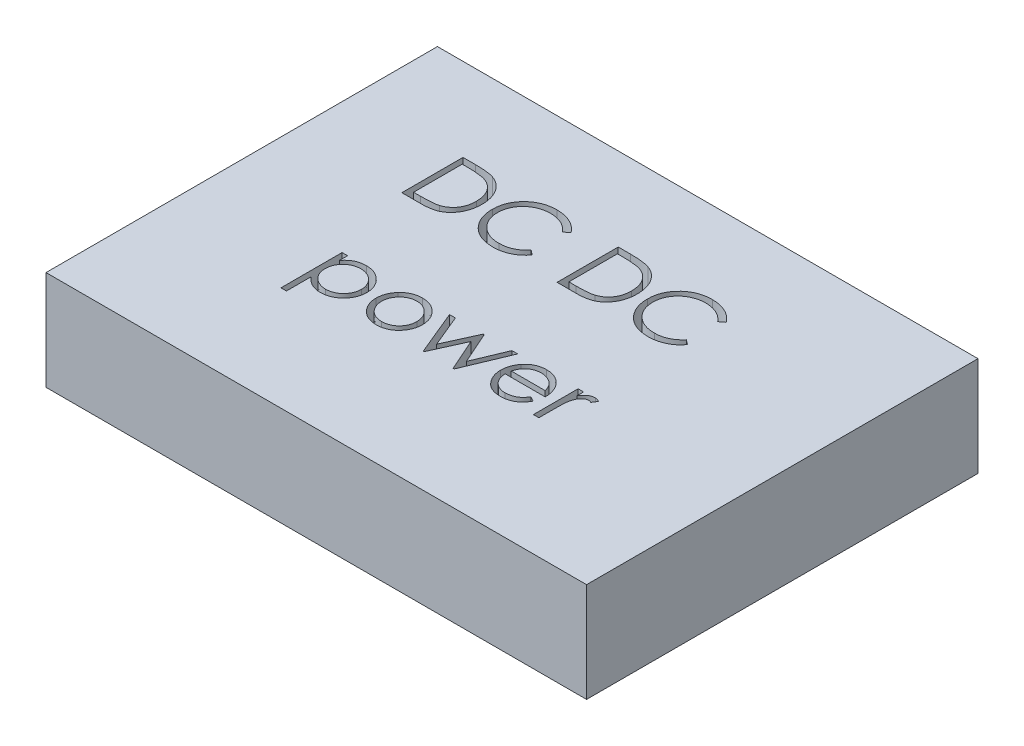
from build123d import *

# Parameters (mm, degrees)
SKETCH1_W           = 22.098
SKETCH1_H           = 16.002
BOSS_EXTRUDE1_DEPTH = 4.064
CUT_EXTRUDE1_DEPTH  = 1


with BuildPart() as part:
    # Sketch1 → Boss-Extrude1 (new body)
    with BuildSketch(Plane(origin=(0, 0, 0), x_dir=(1, 0, 0), z_dir=(0, 1, 0))):
        Rectangle(SKETCH1_W, SKETCH1_H)
    extrude(amount=BOSS_EXTRUDE1_DEPTH)

    # Sketch2 → Cut-Extrude1 (cut)
    # profile 1 of 9: a face of its own
    with BuildSketch(Plane(origin=(0, 4.064, 0), x_dir=(1, 0, 0), z_dir=(0, 1, 0))):
        with BuildLine():
            Line((-6.603142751, 2.100132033), (-6.603142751, 4.600132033))
            Line((-6.603142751, 4.600132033), (-6.098335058, 4.600132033))
            add(Edge.make_bspline(
                [(-6.098335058, 4.600132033), (-6.054428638, 4.599815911), (-5.969601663, 4.599205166), (-5.847021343, 4.595332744), (-5.73360437, 4.588482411), (-5.629723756, 4.578504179), (-5.535094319, 4.566252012), (-5.449981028, 4.55089458), (-5.373943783, 4.532760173), (-5.327179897, 4.517299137), (-5.305065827, 4.509987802)],
                knots=[0, 0, 0, 0, 1.314313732, 2.53924729, 3.670748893, 4.714932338, 5.66265055, 6.526160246, 7.303039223, 8, 8, 8, 8], degree=3))
            add(Edge.make_bspline(
                [(-5.305065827, 4.509987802), (-5.276141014, 4.498965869), (-5.218947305, 4.477171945), (-5.137513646, 4.436060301), (-5.060852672, 4.389479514), (-4.988553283, 4.337368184), (-4.922266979, 4.278250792), (-4.859404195, 4.214638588), (-4.802536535, 4.144218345), (-4.750459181, 4.068450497), (-4.703505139, 3.988227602), (-4.662691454, 3.903702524), (-4.628795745, 3.815304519), (-4.600657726, 3.723279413), (-4.578481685, 3.627424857), (-4.563351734, 3.527629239), (-4.553372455, 3.424286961), (-4.552369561, 3.354162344), (-4.551860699, 3.318581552)],
                knots=[0, 0, 0, 0, 0.984719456, 1.947108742, 2.898477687, 3.838006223, 4.779231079, 5.722358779, 6.681677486, 7.655904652, 8.64651281, 9.637519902, 10.640069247, 11.656948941, 12.698408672, 13.768548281, 14.867775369, 16, 16, 16, 16], degree=3))
            add(Edge.make_bspline(
                [(-4.551860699, 3.318581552), (-4.552309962, 3.287680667), (-4.55319528, 3.226787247), (-4.561144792, 3.13704375), (-4.572699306, 3.049962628), (-4.590588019, 2.965958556), (-4.6123041, 2.884295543), (-4.640135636, 2.80584394), (-4.672018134, 2.729884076), (-4.709196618, 2.657443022), (-4.750011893, 2.588812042), (-4.793813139, 2.524115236), (-4.840553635, 2.464275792), (-4.890679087, 2.409112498), (-4.943541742, 2.358708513), (-4.999487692, 2.312642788), (-5.0586613, 2.271816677), (-5.120797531, 2.234625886), (-5.187709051, 2.202182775), (-5.260663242, 2.174732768), (-5.339971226, 2.151985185), (-5.425438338, 2.133005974), (-5.517212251, 2.117950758), (-5.615382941, 2.107860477), (-5.719799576, 2.101036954), (-5.791499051, 2.10043953), (-5.828403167, 2.100132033)],
                knots=[0, 0, 0, 0, 1.105936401, 2.179363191, 3.223086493, 4.248585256, 5.251745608, 6.245858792, 7.225916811, 8.198733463, 9.158002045, 10.082870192, 10.993790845, 11.873723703, 12.748670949, 13.606408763, 14.465103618, 15.319838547, 16.196477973, 17.123216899, 18.106603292, 19.147568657, 20.255746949, 21.433717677, 22.679120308, 24, 24, 24, 24], degree=3))
            Line((-5.828403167, 2.100132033), (-6.603142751, 2.100132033))
        make_face()
        with BuildLine():
            Line((-6.378783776, 2.356542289), (-6.091824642, 2.356542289))
            add(Edge.make_bspline(
                [(-6.091824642, 2.356542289), (-6.050590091, 2.356719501), (-5.971280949, 2.357060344), (-5.857239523, 2.360051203), (-5.753039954, 2.364938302), (-5.658667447, 2.371777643), (-5.574175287, 2.380826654), (-5.499386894, 2.39091587), (-5.434547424, 2.403485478), (-5.395312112, 2.41487902), (-5.377181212, 2.420144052)],
                knots=[0, 0, 0, 0, 1.375205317, 2.645023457, 3.804390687, 4.853969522, 5.800190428, 6.637939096, 7.370582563, 8, 8, 8, 8], degree=3))
            add(Edge.make_bspline(
                [(-5.377181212, 2.420144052), (-5.354360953, 2.428180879), (-5.309265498, 2.444062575), (-5.244350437, 2.473032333), (-5.183809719, 2.507348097), (-5.126588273, 2.545492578), (-5.073497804, 2.588811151), (-5.02390915, 2.636361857), (-4.977922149, 2.688386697), (-4.936011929, 2.744821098), (-4.898505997, 2.805313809), (-4.866026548, 2.869270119), (-4.837561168, 2.935989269), (-4.815219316, 3.006495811), (-4.797708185, 3.080159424), (-4.785304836, 3.15698529), (-4.777580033, 3.236959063), (-4.776678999, 3.291353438), (-4.776219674, 3.319082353)],
                knots=[0, 0, 0, 0, 0.998632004, 1.973411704, 2.929992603, 3.868527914, 4.809262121, 5.754881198, 6.702106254, 7.672490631, 8.653608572, 9.636854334, 10.631411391, 11.644891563, 12.686317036, 13.754757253, 14.855430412, 16, 16, 16, 16], degree=3))
            add(Edge.make_bspline(
                [(-4.776219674, 3.319082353), (-4.776586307, 3.348320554), (-4.777306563, 3.405759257), (-4.786359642, 3.490038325), (-4.799589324, 3.571095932), (-4.818720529, 3.6489375), (-4.843099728, 3.723714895), (-4.873524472, 3.795014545), (-4.908286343, 3.863589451), (-4.949645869, 3.927856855), (-4.994942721, 3.988637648), (-5.045212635, 4.04431973), (-5.099656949, 4.095029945), (-5.157681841, 4.141558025), (-5.220922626, 4.182032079), (-5.287889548, 4.218236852), (-5.359565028, 4.248962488), (-5.409431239, 4.265304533), (-5.43477336, 4.273609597)],
                knots=[0, 0, 0, 0, 1.122418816, 2.205001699, 3.251619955, 4.274784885, 5.280384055, 6.268708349, 7.249350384, 8.229342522, 9.199999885, 10.157847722, 11.105861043, 12.055065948, 13.010012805, 13.98527497, 14.976112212, 16, 16, 16, 16], degree=3))
            add(Edge.make_bspline(
                [(-5.43477336, 4.273609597), (-5.455738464, 4.279407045), (-5.500316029, 4.291734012), (-5.573058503, 4.305180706), (-5.654926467, 4.317041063), (-5.746283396, 4.327082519), (-5.847025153, 4.334287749), (-5.957229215, 4.339695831), (-6.076943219, 4.343343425), (-6.159930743, 4.343592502), (-6.203002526, 4.343721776)],
                knots=[0, 0, 0, 0, 0.674548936, 1.434276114, 2.292660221, 3.240891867, 4.284742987, 5.42552168, 6.663806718, 8, 8, 8, 8], degree=3))
            Line((-6.203002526, 4.343721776), (-6.378783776, 4.343721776))
            Line((-6.378783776, 4.343721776), (-6.378783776, 2.356542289))
        make_face(mode=Mode.SUBTRACT)
    # profile 2 of 9: a face of its own
    with BuildSketch(Plane(origin=(0, 4.064, 0), x_dir=(1, 0, 0), z_dir=(0, 1, 0))):
        with BuildLine():
            Line((-1.731347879, 4.141398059), (-1.927661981, 3.991157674))
            add(Edge.make_bspline(
                [(-1.927661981, 3.991157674), (-1.941666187, 4.007847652), (-1.969485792, 4.041002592), (-2.014242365, 4.08755941), (-2.060886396, 4.131177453), (-2.109400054, 4.17206451), (-2.160656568, 4.208790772), (-2.213414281, 4.243270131), (-2.268555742, 4.274175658), (-2.344806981, 4.311649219), (-2.444555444, 4.350753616), (-2.570123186, 4.383541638), (-2.701202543, 4.404413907), (-2.790629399, 4.406674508), (-2.836115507, 4.407824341)],
                knots=[0, 0, 0, 0, 0.757959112, 1.505699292, 2.245454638, 2.979532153, 3.711538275, 4.438200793, 5.171680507, 5.909471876, 7.393775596, 8.890124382, 10.418191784, 12, 12, 12, 12], degree=3))
            add(Edge.make_bspline(
                [(-2.836115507, 4.407824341), (-2.861175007, 4.407535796), (-2.91106143, 4.406961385), (-2.985096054, 4.399383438), (-3.057748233, 4.388732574), (-3.128970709, 4.372928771), (-3.198672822, 4.352948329), (-3.267310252, 4.329073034), (-3.333889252, 4.299533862), (-3.399330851, 4.266885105), (-3.462030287, 4.230008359), (-3.521355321, 4.189784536), (-3.577089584, 4.146663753), (-3.629277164, 4.100484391), (-3.677971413, 4.051454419), (-3.722819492, 3.999051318), (-3.763666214, 3.943442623), (-3.801321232, 3.885361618), (-3.835044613, 3.824977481), (-3.863280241, 3.762066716), (-3.8882839, 3.697706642), (-3.908069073, 3.631170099), (-3.923729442, 3.562925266), (-3.934534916, 3.492788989), (-3.942026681, 3.420907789), (-3.942598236, 3.372186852), (-3.94288634, 3.347628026)],
                knots=[0, 0, 0, 0, 1.054917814, 2.100044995, 3.131103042, 4.146048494, 5.169673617, 6.183595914, 7.203665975, 8.234915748, 9.262203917, 10.264457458, 11.251630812, 12.227803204, 13.197192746, 14.159520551, 15.12972552, 16.100847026, 17.073214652, 18.039054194, 19.002613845, 19.979014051, 20.95965708, 21.949030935, 22.966165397, 24, 24, 24, 24], degree=3))
            add(Edge.make_bspline(
                [(-3.94288634, 3.347628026), (-3.941985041, 3.310677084), (-3.940215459, 3.238128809), (-3.924466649, 3.131864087), (-3.900534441, 3.030063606), (-3.864666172, 2.933363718), (-3.820438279, 2.840572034), (-3.764552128, 2.753258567), (-3.69982603, 2.670103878), (-3.625344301, 2.593073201), (-3.543625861, 2.522706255), (-3.455948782, 2.460741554), (-3.362531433, 2.409088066), (-3.264405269, 2.366105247), (-3.160815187, 2.333064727), (-3.051947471, 2.309804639), (-2.938038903, 2.294631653), (-2.860203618, 2.293179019), (-2.820590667, 2.292439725)],
                knots=[0, 0, 0, 0, 1.029171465, 2.020641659, 2.987623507, 3.938342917, 4.889210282, 5.84687017, 6.821220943, 7.821438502, 8.827599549, 9.822697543, 10.807740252, 11.797342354, 12.80366471, 13.83203677, 14.896651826, 16, 16, 16, 16], degree=3))
            add(Edge.make_bspline(
                [(-2.820590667, 2.292439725), (-2.776945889, 2.293645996), (-2.691042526, 2.296020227), (-2.565065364, 2.316133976), (-2.444468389, 2.348746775), (-2.329245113, 2.394388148), (-2.219720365, 2.453720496), (-2.115722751, 2.525647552), (-2.017164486, 2.610853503), (-1.957899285, 2.675912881), (-1.927661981, 2.709106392)],
                knots=[0, 0, 0, 0, 1.028121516, 2.023589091, 2.998037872, 3.967518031, 4.937445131, 5.927275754, 6.942489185, 8, 8, 8, 8], degree=3))
            Line((-1.927661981, 2.709106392), (-1.731347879, 2.560368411))
            add(Edge.make_bspline(
                [(-1.731347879, 2.560368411), (-1.747146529, 2.539983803), (-1.778668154, 2.499312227), (-1.829709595, 2.441975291), (-1.883479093, 2.388043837), (-1.940376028, 2.337952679), (-1.99974588, 2.290699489), (-2.062654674, 2.247626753), (-2.128275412, 2.208133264), (-2.196385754, 2.171971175), (-2.266913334, 2.139887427), (-2.339773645, 2.11242045), (-2.414652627, 2.088759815), (-2.491553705, 2.069294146), (-2.570636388, 2.054100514), (-2.651615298, 2.043943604), (-2.734665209, 2.036985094), (-2.790694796, 2.036350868), (-2.819088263, 2.036029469)],
                knots=[0, 0, 0, 0, 0.986787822, 1.968848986, 2.935600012, 3.899624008, 4.868462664, 5.837806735, 6.815139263, 7.798259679, 8.787526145, 9.778297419, 10.776456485, 11.791383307, 12.812564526, 13.85620153, 14.913611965, 16, 16, 16, 16], degree=3))
            add(Edge.make_bspline(
                [(-2.819088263, 2.036029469), (-2.845976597, 2.036216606), (-2.899144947, 2.036586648), (-2.977644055, 2.042581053), (-3.054065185, 2.050759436), (-3.128189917, 2.063073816), (-3.200422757, 2.077605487), (-3.270108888, 2.097084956), (-3.337934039, 2.11890579), (-3.403625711, 2.144552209), (-3.467239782, 2.173492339), (-3.528571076, 2.206200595), (-3.587591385, 2.242401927), (-3.644880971, 2.281298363), (-3.699593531, 2.324139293), (-3.752203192, 2.370329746), (-3.80300496, 2.41971404), (-3.83443545, 2.455324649), (-3.850238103, 2.473228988)],
                knots=[0, 0, 0, 0, 1.114604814, 2.203992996, 3.262667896, 4.300477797, 5.318619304, 6.316056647, 7.298880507, 8.271930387, 9.238335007, 10.195173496, 11.151986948, 12.108099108, 13.064862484, 14.031167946, 15.010108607, 16, 16, 16, 16], degree=3))
            add(Edge.make_bspline(
                [(-3.850238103, 2.473228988), (-3.875549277, 2.504329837), (-3.925866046, 2.566156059), (-3.990241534, 2.666360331), (-4.045346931, 2.77098048), (-4.08990116, 2.880566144), (-4.124731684, 2.99487142), (-4.148861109, 3.113953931), (-4.164540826, 3.237702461), (-4.16633389, 3.321871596), (-4.167245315, 3.36465527)],
                knots=[0, 0, 0, 0, 0.994628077, 1.977248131, 2.950237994, 3.925870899, 4.908910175, 5.911660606, 6.938484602, 8, 8, 8, 8], degree=3))
            add(Edge.make_bspline(
                [(-4.167245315, 3.36465527), (-4.166134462, 3.409623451), (-4.163948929, 3.49809554), (-4.145380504, 3.627934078), (-4.115509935, 3.752327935), (-4.073083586, 3.871044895), (-4.019294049, 3.984709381), (-3.952846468, 4.092453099), (-3.874512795, 4.194965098), (-3.78490739, 4.290689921), (-3.686645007, 4.37821803), (-3.581417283, 4.455222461), (-3.469430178, 4.519306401), (-3.351917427, 4.572875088), (-3.227999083, 4.614049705), (-3.097939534, 4.64287341), (-2.961983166, 4.660814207), (-2.86922429, 4.663082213), (-2.822093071, 4.664234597)],
                knots=[0, 0, 0, 0, 1.032925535, 2.032216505, 3.007276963, 3.968222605, 4.92396291, 5.891752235, 6.871517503, 7.883894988, 8.900124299, 9.891468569, 10.874487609, 11.85992873, 12.854644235, 13.869047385, 14.917252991, 16, 16, 16, 16], degree=3))
            add(Edge.make_bspline(
                [(-2.822093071, 4.664234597), (-2.793368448, 4.663890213), (-2.73651095, 4.663208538), (-2.652401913, 4.656561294), (-2.570514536, 4.645480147), (-2.490792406, 4.63039724), (-2.41284768, 4.611677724), (-2.33727608, 4.587291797), (-2.263634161, 4.55940856), (-2.192386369, 4.52729537), (-2.123874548, 4.491247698), (-2.058120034, 4.45166511), (-1.995645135, 4.408596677), (-1.936010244, 4.362408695), (-1.88021295, 4.312124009), (-1.826669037, 4.259125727), (-1.777196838, 4.201887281), (-1.746658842, 4.161598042), (-1.731347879, 4.141398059)],
                knots=[0, 0, 0, 0, 1.096760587, 2.17092713, 3.219439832, 4.250915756, 5.268269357, 6.278326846, 7.281116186, 8.274029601, 9.260640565, 10.235837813, 11.203064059, 12.156899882, 13.114053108, 14.069676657, 15.032185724, 16, 16, 16, 16], degree=3))
        make_face()
    # profile 3 of 9: a face of its own
    with BuildSketch(Plane(origin=(0, 4.064, 0), x_dir=(1, 0, 0), z_dir=(0, 1, 0))):
        with BuildLine():
            Line((-0.256988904, 2.100132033), (-0.256988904, 4.600132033))
            Line((-0.256988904, 4.600132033), (0.247818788, 4.600132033))
            add(Edge.make_bspline(
                [(0.247818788, 4.600132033), (0.291725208, 4.599815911), (0.376552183, 4.599205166), (0.499132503, 4.595332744), (0.612549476, 4.588482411), (0.71643009, 4.578504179), (0.811059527, 4.566252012), (0.896172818, 4.55089458), (0.972210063, 4.532760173), (1.018973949, 4.517299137), (1.041088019, 4.509987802)],
                knots=[0, 0, 0, 0, 1.314313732, 2.53924729, 3.670748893, 4.714932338, 5.66265055, 6.526160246, 7.303039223, 8, 8, 8, 8], degree=3))
            add(Edge.make_bspline(
                [(1.041088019, 4.509987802), (1.070012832, 4.498965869), (1.127206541, 4.477171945), (1.2086402, 4.436060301), (1.285301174, 4.389479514), (1.357600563, 4.337368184), (1.423886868, 4.278250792), (1.486749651, 4.214638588), (1.543617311, 4.144218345), (1.595694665, 4.068450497), (1.642648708, 3.988227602), (1.683462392, 3.903702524), (1.717358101, 3.815304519), (1.74549612, 3.723279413), (1.767672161, 3.627424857), (1.782802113, 3.527629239), (1.792781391, 3.424286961), (1.793784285, 3.354162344), (1.794293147, 3.318581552)],
                knots=[0, 0, 0, 0, 0.984719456, 1.947108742, 2.898477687, 3.838006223, 4.779231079, 5.722358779, 6.681677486, 7.655904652, 8.64651281, 9.637519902, 10.640069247, 11.656948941, 12.698408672, 13.768548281, 14.867775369, 16, 16, 16, 16], degree=3))
            add(Edge.make_bspline(
                [(1.794293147, 3.318581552), (1.793843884, 3.287680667), (1.792958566, 3.226787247), (1.785009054, 3.13704375), (1.77345454, 3.049962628), (1.755565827, 2.965958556), (1.733849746, 2.884295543), (1.70601821, 2.80584394), (1.674135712, 2.729884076), (1.636957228, 2.657443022), (1.596141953, 2.588812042), (1.552340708, 2.524115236), (1.505600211, 2.464275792), (1.455474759, 2.409112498), (1.402612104, 2.358708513), (1.346666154, 2.312642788), (1.287492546, 2.271816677), (1.225356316, 2.234625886), (1.158444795, 2.202182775), (1.085490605, 2.174732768), (1.00618262, 2.151985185), (0.920715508, 2.133005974), (0.828941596, 2.117950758), (0.730770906, 2.107860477), (0.62635427, 2.101036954), (0.554654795, 2.10043953), (0.517750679, 2.100132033)],
                knots=[0, 0, 0, 0, 1.105936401, 2.179363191, 3.223086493, 4.248585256, 5.251745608, 6.245858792, 7.225916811, 8.198733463, 9.158002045, 10.082870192, 10.993790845, 11.873723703, 12.748670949, 13.606408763, 14.465103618, 15.319838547, 16.196477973, 17.123216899, 18.106603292, 19.147568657, 20.255746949, 21.433717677, 22.679120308, 24, 24, 24, 24], degree=3))
            Line((0.517750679, 2.100132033), (-0.256988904, 2.100132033))
        make_face()
        with BuildLine():
            Line((-0.03262993, 2.356542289), (0.254329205, 2.356542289))
            add(Edge.make_bspline(
                [(0.254329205, 2.356542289), (0.295563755, 2.356719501), (0.374872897, 2.357060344), (0.488914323, 2.360051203), (0.593113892, 2.364938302), (0.687486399, 2.371777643), (0.771978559, 2.380826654), (0.846766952, 2.39091587), (0.911606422, 2.403485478), (0.950841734, 2.41487902), (0.968972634, 2.420144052)],
                knots=[0, 0, 0, 0, 1.375205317, 2.645023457, 3.804390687, 4.853969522, 5.800190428, 6.637939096, 7.370582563, 8, 8, 8, 8], degree=3))
            add(Edge.make_bspline(
                [(0.968972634, 2.420144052), (0.991792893, 2.428180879), (1.036888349, 2.444062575), (1.101803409, 2.473032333), (1.162344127, 2.507348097), (1.219565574, 2.545492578), (1.272656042, 2.588811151), (1.322244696, 2.636361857), (1.368231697, 2.688386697), (1.410141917, 2.744821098), (1.447647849, 2.805313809), (1.480127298, 2.869270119), (1.508592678, 2.935989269), (1.53093453, 3.006495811), (1.548445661, 3.080159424), (1.56084901, 3.15698529), (1.568573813, 3.236959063), (1.569474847, 3.291353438), (1.569934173, 3.319082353)],
                knots=[0, 0, 0, 0, 0.998632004, 1.973411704, 2.929992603, 3.868527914, 4.809262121, 5.754881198, 6.702106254, 7.672490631, 8.653608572, 9.636854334, 10.631411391, 11.644891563, 12.686317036, 13.754757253, 14.855430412, 16, 16, 16, 16], degree=3))
            add(Edge.make_bspline(
                [(1.569934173, 3.319082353), (1.569567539, 3.348320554), (1.568847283, 3.405759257), (1.559794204, 3.490038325), (1.546564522, 3.571095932), (1.527433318, 3.6489375), (1.503054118, 3.723714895), (1.472629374, 3.795014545), (1.437867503, 3.863589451), (1.396507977, 3.927856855), (1.351211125, 3.988637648), (1.300941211, 4.04431973), (1.246496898, 4.095029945), (1.188472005, 4.141558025), (1.12523122, 4.182032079), (1.058264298, 4.218236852), (0.986588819, 4.248962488), (0.936722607, 4.265304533), (0.911380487, 4.273609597)],
                knots=[0, 0, 0, 0, 1.122418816, 2.205001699, 3.251619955, 4.274784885, 5.280384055, 6.268708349, 7.249350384, 8.229342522, 9.199999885, 10.157847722, 11.105861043, 12.055065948, 13.010012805, 13.98527497, 14.976112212, 16, 16, 16, 16], degree=3))
            add(Edge.make_bspline(
                [(0.911380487, 4.273609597), (0.890415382, 4.279407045), (0.845837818, 4.291734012), (0.773095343, 4.305180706), (0.691227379, 4.317041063), (0.59987045, 4.327082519), (0.499128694, 4.334287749), (0.388924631, 4.339695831), (0.269210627, 4.343343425), (0.186223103, 4.343592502), (0.14315132, 4.343721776)],
                knots=[0, 0, 0, 0, 0.674548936, 1.434276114, 2.292660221, 3.240891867, 4.284742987, 5.42552168, 6.663806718, 8, 8, 8, 8], degree=3))
            Line((0.14315132, 4.343721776), (-0.03262993, 4.343721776))
            Line((-0.03262993, 4.343721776), (-0.03262993, 2.356542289))
        make_face(mode=Mode.SUBTRACT)
    # profile 4 of 9: a face of its own
    with BuildSketch(Plane(origin=(0, 4.064, 0), x_dir=(1, 0, 0), z_dir=(0, 1, 0))):
        with BuildLine():
            Line((4.614805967, 4.141398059), (4.418491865, 3.991157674))
            add(Edge.make_bspline(
                [(4.418491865, 3.991157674), (4.404487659, 4.007847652), (4.376668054, 4.041002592), (4.331911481, 4.08755941), (4.28526745, 4.131177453), (4.236753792, 4.17206451), (4.185497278, 4.208790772), (4.132739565, 4.243270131), (4.077598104, 4.274175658), (4.001346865, 4.311649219), (3.901598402, 4.350753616), (3.77603066, 4.383541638), (3.644951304, 4.404413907), (3.555524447, 4.406674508), (3.510038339, 4.407824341)],
                knots=[0, 0, 0, 0, 0.757959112, 1.505699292, 2.245454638, 2.979532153, 3.711538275, 4.438200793, 5.171680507, 5.909471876, 7.393775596, 8.890124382, 10.418191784, 12, 12, 12, 12], degree=3))
            add(Edge.make_bspline(
                [(3.510038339, 4.407824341), (3.48497884, 4.407535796), (3.435092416, 4.406961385), (3.361057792, 4.399383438), (3.288405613, 4.388732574), (3.217183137, 4.372928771), (3.147481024, 4.352948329), (3.078843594, 4.329073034), (3.012264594, 4.299533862), (2.946822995, 4.266885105), (2.884123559, 4.230008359), (2.824798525, 4.189784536), (2.769064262, 4.146663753), (2.716876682, 4.100484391), (2.668182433, 4.051454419), (2.623334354, 3.999051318), (2.582487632, 3.943442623), (2.544832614, 3.885361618), (2.511109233, 3.824977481), (2.482873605, 3.762066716), (2.457869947, 3.697706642), (2.438084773, 3.631170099), (2.422424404, 3.562925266), (2.41161893, 3.492788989), (2.404127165, 3.420907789), (2.40355561, 3.372186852), (2.403267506, 3.347628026)],
                knots=[0, 0, 0, 0, 1.054917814, 2.100044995, 3.131103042, 4.146048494, 5.169673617, 6.183595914, 7.203665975, 8.234915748, 9.262203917, 10.264457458, 11.251630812, 12.227803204, 13.197192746, 14.159520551, 15.12972552, 16.100847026, 17.073214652, 18.039054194, 19.002613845, 19.979014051, 20.95965708, 21.949030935, 22.966165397, 24, 24, 24, 24], degree=3))
            add(Edge.make_bspline(
                [(2.403267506, 3.347628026), (2.404168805, 3.310677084), (2.405938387, 3.238128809), (2.421687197, 3.131864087), (2.445619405, 3.030063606), (2.481487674, 2.933363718), (2.525715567, 2.840572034), (2.581601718, 2.753258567), (2.646327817, 2.670103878), (2.720809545, 2.593073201), (2.802527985, 2.522706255), (2.890205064, 2.460741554), (2.983622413, 2.409088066), (3.081748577, 2.366105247), (3.185338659, 2.333064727), (3.294206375, 2.309804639), (3.408114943, 2.294631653), (3.485950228, 2.293179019), (3.525563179, 2.292439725)],
                knots=[0, 0, 0, 0, 1.029171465, 2.020641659, 2.987623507, 3.938342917, 4.889210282, 5.84687017, 6.821220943, 7.821438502, 8.827599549, 9.822697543, 10.807740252, 11.797342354, 12.80366471, 13.83203677, 14.896651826, 16, 16, 16, 16], degree=3))
            add(Edge.make_bspline(
                [(3.525563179, 2.292439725), (3.569207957, 2.293645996), (3.65511132, 2.296020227), (3.781088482, 2.316133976), (3.901685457, 2.348746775), (4.016908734, 2.394388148), (4.126433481, 2.453720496), (4.230431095, 2.525647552), (4.32898936, 2.610853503), (4.388254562, 2.675912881), (4.418491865, 2.709106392)],
                knots=[0, 0, 0, 0, 1.028121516, 2.023589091, 2.998037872, 3.967518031, 4.937445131, 5.927275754, 6.942489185, 8, 8, 8, 8], degree=3))
            Line((4.418491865, 2.709106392), (4.614805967, 2.560368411))
            add(Edge.make_bspline(
                [(4.614805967, 2.560368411), (4.599007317, 2.539983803), (4.567485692, 2.499312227), (4.516444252, 2.441975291), (4.462674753, 2.388043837), (4.405777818, 2.337952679), (4.346407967, 2.290699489), (4.283499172, 2.247626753), (4.217878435, 2.208133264), (4.149768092, 2.171971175), (4.079240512, 2.139887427), (4.006380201, 2.11242045), (3.931501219, 2.088759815), (3.854600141, 2.069294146), (3.775517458, 2.054100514), (3.694538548, 2.043943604), (3.611488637, 2.036985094), (3.55545905, 2.036350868), (3.527065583, 2.036029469)],
                knots=[0, 0, 0, 0, 0.986787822, 1.968848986, 2.935600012, 3.899624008, 4.868462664, 5.837806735, 6.815139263, 7.798259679, 8.787526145, 9.778297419, 10.776456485, 11.791383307, 12.812564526, 13.85620153, 14.913611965, 16, 16, 16, 16], degree=3))
            add(Edge.make_bspline(
                [(3.527065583, 2.036029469), (3.500177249, 2.036216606), (3.447008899, 2.036586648), (3.368509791, 2.042581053), (3.292088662, 2.050759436), (3.217963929, 2.063073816), (3.14573109, 2.077605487), (3.076044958, 2.097084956), (3.008219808, 2.11890579), (2.942528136, 2.144552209), (2.878914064, 2.173492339), (2.81758277, 2.206200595), (2.758562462, 2.242401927), (2.701272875, 2.281298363), (2.646560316, 2.324139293), (2.593950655, 2.370329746), (2.543148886, 2.41971404), (2.511718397, 2.455324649), (2.495915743, 2.473228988)],
                knots=[0, 0, 0, 0, 1.114604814, 2.203992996, 3.262667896, 4.300477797, 5.318619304, 6.316056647, 7.298880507, 8.271930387, 9.238335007, 10.195173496, 11.151986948, 12.108099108, 13.064862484, 14.031167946, 15.010108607, 16, 16, 16, 16], degree=3))
            add(Edge.make_bspline(
                [(2.495915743, 2.473228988), (2.470604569, 2.504329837), (2.4202878, 2.566156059), (2.355912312, 2.666360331), (2.300806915, 2.77098048), (2.256252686, 2.880566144), (2.221422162, 2.99487142), (2.197292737, 3.113953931), (2.18161302, 3.237702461), (2.179819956, 3.321871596), (2.178908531, 3.36465527)],
                knots=[0, 0, 0, 0, 0.994628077, 1.977248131, 2.950237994, 3.925870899, 4.908910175, 5.911660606, 6.938484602, 8, 8, 8, 8], degree=3))
            add(Edge.make_bspline(
                [(2.178908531, 3.36465527), (2.180019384, 3.409623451), (2.182204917, 3.49809554), (2.200773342, 3.627934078), (2.230643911, 3.752327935), (2.27307026, 3.871044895), (2.326859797, 3.984709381), (2.393307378, 4.092453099), (2.471641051, 4.194965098), (2.561246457, 4.290689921), (2.659508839, 4.37821803), (2.764736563, 4.455222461), (2.876723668, 4.519306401), (2.994236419, 4.572875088), (3.118154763, 4.614049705), (3.248214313, 4.64287341), (3.38417068, 4.660814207), (3.476929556, 4.663082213), (3.524060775, 4.664234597)],
                knots=[0, 0, 0, 0, 1.032925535, 2.032216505, 3.007276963, 3.968222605, 4.92396291, 5.891752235, 6.871517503, 7.883894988, 8.900124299, 9.891468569, 10.874487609, 11.85992873, 12.854644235, 13.869047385, 14.917252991, 16, 16, 16, 16], degree=3))
            add(Edge.make_bspline(
                [(3.524060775, 4.664234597), (3.552785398, 4.663890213), (3.609642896, 4.663208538), (3.693751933, 4.656561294), (3.77563931, 4.645480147), (3.85536144, 4.63039724), (3.933306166, 4.611677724), (4.008877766, 4.587291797), (4.082519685, 4.55940856), (4.153767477, 4.52729537), (4.222279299, 4.491247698), (4.288033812, 4.45166511), (4.350508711, 4.408596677), (4.410143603, 4.362408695), (4.465940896, 4.312124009), (4.519484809, 4.259125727), (4.568957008, 4.201887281), (4.599495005, 4.161598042), (4.614805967, 4.141398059)],
                knots=[0, 0, 0, 0, 1.096760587, 2.17092713, 3.219439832, 4.250915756, 5.268269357, 6.278326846, 7.281116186, 8.274029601, 9.260640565, 10.235837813, 11.203064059, 12.156899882, 13.114053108, 14.069676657, 15.032185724, 16, 16, 16, 16], degree=3))
        make_face()
    # profile 5 of 9: a face of its own
    with BuildSketch(Plane(origin=(0, 4.064, 0), x_dir=(1, 0, 0), z_dir=(0, 1, 0))):
        with BuildLine():
            Line((-5.705706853, -1.239611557), (-5.481347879, -1.239611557))
            Line((-5.481347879, -1.239611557), (-5.481347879, -1.577652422))
            add(Edge.make_bspline(
                [(-5.481347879, -1.577652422), (-5.457521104, -1.546982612), (-5.411218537, -1.487381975), (-5.331415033, -1.410246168), (-5.247181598, -1.34519238), (-5.156350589, -1.294204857), (-5.060333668, -1.25576142), (-4.95952487, -1.227347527), (-4.853068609, -1.210603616), (-4.780285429, -1.208588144), (-4.743166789, -1.207560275)],
                knots=[0, 0, 0, 0, 1.0828784, 2.104357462, 3.088488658, 4.04616522, 5.001424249, 5.969181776, 6.964304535, 8, 8, 8, 8], degree=3))
            add(Edge.make_bspline(
                [(-4.743166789, -1.207560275), (-4.710744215, -1.20849826), (-4.646659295, -1.210352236), (-4.552328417, -1.222904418), (-4.461488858, -1.244417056), (-4.374654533, -1.275417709), (-4.290895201, -1.313743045), (-4.211450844, -1.362112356), (-4.135084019, -1.418116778), (-4.063715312, -1.482568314), (-3.997771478, -1.55230279), (-3.940738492, -1.627318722), (-3.891544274, -1.705149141), (-3.851779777, -1.787000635), (-3.820630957, -1.872228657), (-3.798477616, -1.961177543), (-3.785293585, -2.0535175), (-3.783524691, -2.116305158), (-3.78262993, -2.148065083)],
                knots=[0, 0, 0, 0, 1.041296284, 2.058176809, 3.050446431, 4.034000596, 5.01514041, 6.003636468, 7.015969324, 8.052561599, 9.08815499, 10.094063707, 11.074456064, 12.040834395, 13.011057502, 13.983766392, 14.980127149, 16, 16, 16, 16], degree=3))
            add(Edge.make_bspline(
                [(-3.78262993, -2.148065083), (-3.783505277, -2.180495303), (-3.785231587, -2.244452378), (-3.798620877, -2.338371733), (-3.820018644, -2.428719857), (-3.850774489, -2.515346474), (-3.89051841, -2.598191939), (-3.93887881, -2.677196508), (-3.995940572, -2.752334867), (-4.061155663, -2.822586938), (-4.131907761, -2.887300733), (-4.207534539, -2.943899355), (-4.286862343, -2.991428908), (-4.369485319, -3.031131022), (-4.456110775, -3.061054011), (-4.546334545, -3.082638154), (-4.640107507, -3.095948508), (-4.703894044, -3.097700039), (-4.736155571, -3.098585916)],
                knots=[0, 0, 0, 0, 1.038740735, 2.04854663, 3.033179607, 4.009277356, 4.987731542, 5.972001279, 6.972200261, 8.005528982, 9.039189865, 10.040446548, 11.026516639, 11.997840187, 12.972163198, 13.956796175, 14.96660207, 16, 16, 16, 16], degree=3))
            add(Edge.make_bspline(
                [(-4.736155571, -3.098585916), (-4.77246098, -3.097661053), (-4.844174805, -3.095834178), (-4.949030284, -3.077320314), (-5.049942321, -3.049651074), (-5.14579291, -3.009151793), (-5.237341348, -2.95754071), (-5.324069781, -2.894604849), (-5.40643889, -2.820475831), (-5.456016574, -2.76423882), (-5.481347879, -2.735504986)],
                knots=[0, 0, 0, 0, 1.014726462, 2.004382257, 2.969841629, 3.936926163, 4.907207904, 5.903978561, 6.929055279, 8, 8, 8, 8], degree=3))
            Line((-5.481347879, -2.735504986), (-5.481347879, -3.739611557))
            Line((-5.481347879, -3.739611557), (-5.705706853, -3.739611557))
            Line((-5.705706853, -3.739611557), (-5.705706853, -1.239611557))
        make_face()
        with BuildLine():
            add(Edge.make_bspline(
                [(-4.745169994, -1.431919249), (-4.770583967, -1.432376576), (-4.82061753, -1.433276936), (-4.893954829, -1.443972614), (-4.964594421, -1.459499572), (-5.031824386, -1.483008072), (-5.096289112, -1.511864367), (-5.157492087, -1.547922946), (-5.215390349, -1.590531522), (-5.269838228, -1.638873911), (-5.319026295, -1.692141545), (-5.362571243, -1.74898998), (-5.39914789, -1.809347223), (-5.429506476, -1.872651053), (-5.452608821, -1.939397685), (-5.469005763, -2.00920698), (-5.479313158, -2.082155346), (-5.480662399, -2.131838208), (-5.481347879, -2.157079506)],
                knots=[0, 0, 0, 0, 1.05670511, 2.080379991, 3.077984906, 4.06214886, 5.038337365, 6.01289324, 7.01187578, 8.025460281, 9.038092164, 10.024533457, 11.000252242, 11.969694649, 12.940728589, 13.933144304, 14.949937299, 16, 16, 16, 16], degree=3))
            add(Edge.make_bspline(
                [(-5.481347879, -2.157079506), (-5.480211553, -2.190213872), (-5.477985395, -2.255126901), (-5.459887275, -2.349972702), (-5.430433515, -2.439723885), (-5.38862729, -2.523624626), (-5.335807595, -2.600755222), (-5.272166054, -2.669819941), (-5.198278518, -2.730384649), (-5.115373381, -2.78139983), (-5.02650043, -2.822819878), (-4.933796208, -2.852472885), (-4.838535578, -2.870738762), (-4.774129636, -2.873057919), (-4.741664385, -2.874226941)],
                knots=[0, 0, 0, 0, 1.03728447, 2.032128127, 3.01272805, 3.987917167, 4.958271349, 5.931593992, 6.91984656, 7.941419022, 8.973179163, 9.983609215, 10.983593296, 12, 12, 12, 12], degree=3))
            add(Edge.make_bspline(
                [(-4.741664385, -2.874226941), (-4.709853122, -2.873115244), (-4.646713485, -2.870908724), (-4.553743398, -2.851810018), (-4.463392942, -2.822635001), (-4.377549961, -2.78009246), (-4.296961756, -2.727956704), (-4.224189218, -2.665413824), (-4.160612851, -2.592921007), (-4.106424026, -2.512200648), (-4.062758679, -2.425646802), (-4.029951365, -2.336088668), (-4.01101667, -2.243841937), (-4.008333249, -2.181700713), (-4.006988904, -2.150569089)],
                knots=[0, 0, 0, 0, 1.00104056, 1.986885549, 2.97790532, 3.984399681, 4.995088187, 5.994304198, 6.996462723, 8.023150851, 9.048424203, 10.043036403, 11.019596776, 12, 12, 12, 12], degree=3))
            add(Edge.make_bspline(
                [(-4.006988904, -2.150569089), (-4.008028, -2.119244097), (-4.010098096, -2.056838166), (-4.030488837, -1.964864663), (-4.061131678, -1.87494468), (-4.105816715, -1.789572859), (-4.158817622, -1.709019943), (-4.22292262, -1.637910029), (-4.294791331, -1.575645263), (-4.375283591, -1.524205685), (-4.46166961, -1.483287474), (-4.552608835, -1.453370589), (-4.64763998, -1.43538934), (-4.712374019, -1.433086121), (-4.745169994, -1.431919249)],
                knots=[0, 0, 0, 0, 0.983928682, 1.960191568, 2.949917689, 3.96440592, 4.982380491, 5.975291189, 6.965713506, 7.964880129, 8.970154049, 9.96478489, 10.968906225, 12, 12, 12, 12], degree=3))
        make_face(mode=Mode.SUBTRACT)
    # profile 6 of 9: a face of its own
    with BuildSketch(Plane(origin=(0, 4.064, 0), x_dir=(1, 0, 0), z_dir=(0, 1, 0))):
        with BuildLine():
            add(Edge.make_bspline(
                [(-2.451500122, -1.207560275), (-2.417220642, -1.208290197), (-2.350006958, -1.209721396), (-2.251572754, -1.2250178), (-2.157611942, -1.248408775), (-2.067764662, -1.280745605), (-1.983181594, -1.324089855), (-1.902630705, -1.375810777), (-1.826332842, -1.437084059), (-1.780602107, -1.484482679), (-1.757389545, -1.508541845)],
                knots=[0, 0, 0, 0, 1.054011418, 2.066658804, 3.057071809, 4.030435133, 4.997543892, 5.974964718, 6.972108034, 8, 8, 8, 8], degree=3))
            add(Edge.make_bspline(
                [(-1.757389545, -1.508541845), (-1.737402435, -1.531551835), (-1.697815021, -1.577126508), (-1.647053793, -1.651023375), (-1.603324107, -1.727552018), (-1.568279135, -1.80772868), (-1.540646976, -1.890853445), (-1.521028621, -1.977212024), (-1.509359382, -2.066613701), (-1.507785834, -2.127330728), (-1.506988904, -2.158081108)],
                knots=[0, 0, 0, 0, 1.025258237, 2.030674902, 3.01204498, 3.988269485, 4.97094183, 5.956517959, 6.965070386, 8, 8, 8, 8], degree=3))
            add(Edge.make_bspline(
                [(-1.506988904, -2.158081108), (-1.50768986, -2.189009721), (-1.50907498, -2.250126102), (-1.522177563, -2.340139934), (-1.54255691, -2.427421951), (-1.571722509, -2.511606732), (-1.609121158, -2.592951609), (-1.654757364, -2.671101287), (-1.708951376, -2.746209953), (-1.770382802, -2.817639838), (-1.838276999, -2.883472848), (-1.911931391, -2.940850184), (-1.989898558, -2.990008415), (-2.073215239, -3.029605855), (-2.161120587, -3.06082707), (-2.253804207, -3.082755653), (-2.351122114, -3.096013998), (-2.417570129, -3.097716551), (-2.451500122, -3.098585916)],
                knots=[0, 0, 0, 0, 0.998656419, 1.973391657, 2.932242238, 3.890759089, 4.846373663, 5.82037756, 6.809684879, 7.83454468, 8.860553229, 9.859544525, 10.845671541, 11.83227036, 12.833544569, 13.85385346, 14.904124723, 16, 16, 16, 16], degree=3))
            add(Edge.make_bspline(
                [(-2.451500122, -3.098585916), (-2.485596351, -3.097713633), (-2.552375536, -3.096005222), (-2.650036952, -3.082807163), (-2.74288668, -3.060837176), (-2.830907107, -3.029503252), (-2.914581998, -2.99000715), (-2.993000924, -2.9409988), (-3.06671515, -2.883455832), (-3.13462371, -2.817644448), (-3.196051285, -2.746208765), (-3.250246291, -2.671101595), (-3.295882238, -2.592951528), (-3.333280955, -2.511606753), (-3.362446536, -2.427421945), (-3.382825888, -2.340139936), (-3.39592847, -2.250126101), (-3.39731359, -2.189009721), (-3.398014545, -2.158081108)],
                knots=[0, 0, 0, 0, 1.099876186, 2.154163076, 3.173186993, 4.173200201, 5.163417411, 6.152872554, 7.150605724, 8.17532212, 9.198891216, 10.186952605, 11.159729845, 12.11414092, 13.071450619, 14.029093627, 15.002601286, 16, 16, 16, 16], degree=3))
            add(Edge.make_bspline(
                [(-3.398014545, -2.158081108), (-3.397212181, -2.127497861), (-3.395623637, -2.066948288), (-3.383966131, -1.977714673), (-3.364424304, -1.891502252), (-3.336759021, -1.808698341), (-3.301391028, -1.72887303), (-3.258275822, -1.652155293), (-3.206996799, -1.578592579), (-3.167566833, -1.533076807), (-3.147613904, -1.510044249)],
                knots=[0, 0, 0, 0, 1.031353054, 2.041901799, 3.029428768, 4.008703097, 4.981709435, 5.96992636, 6.972712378, 8, 8, 8, 8], degree=3))
            add(Edge.make_bspline(
                [(-3.147613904, -1.510044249), (-3.124436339, -1.485776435), (-3.07885358, -1.43804951), (-3.002175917, -1.37695485), (-2.921823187, -1.324157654), (-2.836305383, -1.281674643), (-2.746531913, -1.248218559), (-2.652089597, -1.224957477), (-2.553321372, -1.209776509), (-2.485778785, -1.208306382), (-2.451500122, -1.207560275)],
                knots=[0, 0, 0, 0, 1.027980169, 2.021703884, 2.998553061, 3.971491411, 4.943284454, 5.930300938, 6.949603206, 8, 8, 8, 8], degree=3))
        make_face()
        with BuildLine():
            add(Edge.make_bspline(
                [(-2.452501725, -1.431919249), (-2.476742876, -1.432608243), (-2.524599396, -1.433968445), (-2.595041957, -1.444314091), (-2.662856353, -1.460705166), (-2.728171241, -1.483993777), (-2.790766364, -1.514064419), (-2.850701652, -1.550998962), (-2.908153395, -1.594308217), (-2.961997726, -1.643924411), (-3.011413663, -1.698123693), (-3.054612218, -1.755872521), (-3.091344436, -1.816234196), (-3.12194455, -1.87927149), (-3.144735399, -1.945623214), (-3.161287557, -2.014537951), (-3.171623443, -2.086156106), (-3.172970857, -2.134842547), (-3.173655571, -2.159583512)],
                knots=[0, 0, 0, 0, 1.021534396, 2.016698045, 2.994645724, 3.958388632, 4.93408049, 5.916473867, 6.921342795, 7.962252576, 8.998418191, 10.008913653, 10.997312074, 11.973003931, 12.956656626, 13.948281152, 14.957379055, 16, 16, 16, 16], degree=3))
            add(Edge.make_bspline(
                [(-3.173655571, -2.159583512), (-3.17250784, -2.191549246), (-3.170229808, -2.25499525), (-3.151704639, -2.348431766), (-3.120714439, -2.438133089), (-3.078866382, -2.523573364), (-3.026433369, -2.602624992), (-2.964656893, -2.673104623), (-2.894199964, -2.733951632), (-2.815902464, -2.78443795), (-2.731363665, -2.824552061), (-2.641894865, -2.852979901), (-2.548580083, -2.871459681), (-2.484808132, -2.873296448), (-2.452501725, -2.874226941)],
                knots=[0, 0, 0, 0, 1.016792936, 2.018143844, 3.017858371, 4.030088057, 5.03801393, 6.028138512, 7.003788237, 7.991172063, 8.984598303, 9.972568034, 10.972917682, 12, 12, 12, 12], degree=3))
            add(Edge.make_bspline(
                [(-2.452501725, -2.874226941), (-2.420197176, -2.873291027), (-2.356428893, -2.871443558), (-2.263243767, -2.853072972), (-2.174019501, -2.8244275), (-2.08956851, -2.784483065), (-2.01130665, -2.733759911), (-1.940342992, -2.673448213), (-1.879093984, -2.60243832), (-1.826712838, -2.523468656), (-1.78417945, -2.438265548), (-1.753334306, -2.34841521), (-1.734764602, -2.254999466), (-1.732492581, -2.191550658), (-1.731347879, -2.159583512)],
                knots=[0, 0, 0, 0, 1.02726834, 2.027799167, 3.010890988, 4.004497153, 4.992059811, 5.971914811, 6.958719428, 7.966827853, 8.981595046, 9.981490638, 10.983022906, 12, 12, 12, 12], degree=3))
            add(Edge.make_bspline(
                [(-1.731347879, -2.159583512), (-1.732032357, -2.134842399), (-1.733379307, -2.086155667), (-1.743718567, -2.014539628), (-1.760258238, -1.945617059), (-1.783095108, -1.8792942), (-1.81356226, -1.816070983), (-1.851002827, -1.756049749), (-1.894024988, -1.697923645), (-1.944037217, -1.644099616), (-1.997825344, -1.594288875), (-2.055300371, -1.550982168), (-2.115146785, -1.514226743), (-2.177560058, -1.483736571), (-2.242883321, -1.460917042), (-2.310602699, -1.444219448), (-2.380744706, -1.434012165), (-2.428429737, -1.43262135), (-2.452501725, -1.431919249)],
                knots=[0, 0, 0, 0, 1.042956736, 2.052379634, 3.044323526, 4.02829302, 5.004299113, 5.996692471, 7.007513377, 8.048758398, 9.090003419, 10.095195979, 11.07790575, 12.047570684, 13.018257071, 13.989683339, 14.985167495, 16, 16, 16, 16], degree=3))
        make_face(mode=Mode.SUBTRACT)
    # profile 7 of 9: a face of its own
    with BuildSketch(Plane(origin=(0, 4.064, 0), x_dir=(1, 0, 0), z_dir=(0, 1, 0))):
        Polygon((-1.314681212, -1.239611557), (-1.073795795, -1.239611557), (-0.529424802, -2.553714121), (0.067029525, -1.239611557), (0.105090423, -1.239611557), (0.688523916, -2.553714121), (1.237902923, -1.239611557), (1.473780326, -1.239611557), (0.710058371, -3.066534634), (0.663483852, -3.066534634), (0.079549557, -1.75243207), (-0.516403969, -3.066534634), (-0.557970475, -3.066534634), align=None)
    # profile 8 of 9: a face of its own
    with BuildSketch(Plane(origin=(0, 4.064, 0), x_dir=(1, 0, 0), z_dir=(0, 1, 0))):
        with BuildLine():
            Line((3.261640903, -2.489611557), (3.460959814, -2.594279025))
            add(Edge.make_bspline(
                [(3.460959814, -2.594279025), (3.445076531, -2.622452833), (3.414173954, -2.677267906), (3.361030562, -2.752576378), (3.305321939, -2.820324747), (3.244533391, -2.878703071), (3.18048362, -2.929596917), (3.112817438, -2.974123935), (3.041182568, -3.012065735), (2.965575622, -3.044031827), (2.885361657, -3.068610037), (2.800346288, -3.085970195), (2.710366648, -3.096701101), (2.648690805, -3.09794763), (2.617109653, -3.098585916)],
                knots=[0, 0, 0, 0, 1.120438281, 2.179929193, 3.190490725, 4.156257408, 5.095198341, 6.022838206, 6.959905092, 7.901321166, 8.864066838, 9.862729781, 10.905609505, 12, 12, 12, 12], degree=3))
            add(Edge.make_bspline(
                [(2.617109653, -3.098585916), (2.582008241, -3.097766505), (2.513535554, -3.096168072), (2.413864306, -3.08238774), (2.320021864, -3.059907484), (2.232013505, -3.028503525), (2.150054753, -2.987484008), (2.073982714, -2.93751295), (2.003397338, -2.878847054), (1.940522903, -2.810978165), (1.88392013, -2.738348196), (1.833973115, -2.662665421), (1.792217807, -2.584120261), (1.758251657, -2.503212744), (1.730819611, -2.42045282), (1.711700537, -2.335087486), (1.700679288, -2.247347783), (1.698990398, -2.187992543), (1.698139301, -2.158081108)],
                knots=[0, 0, 0, 0, 1.145258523, 2.234067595, 3.276747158, 4.290159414, 5.277019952, 6.260822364, 7.254936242, 8.264827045, 9.274100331, 10.257902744, 11.220704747, 12.172965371, 13.118907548, 14.062713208, 15.023725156, 16, 16, 16, 16], degree=3))
            add(Edge.make_bspline(
                [(1.698139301, -2.158081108), (1.69889583, -2.130013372), (1.700395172, -2.074386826), (1.709845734, -1.992054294), (1.726594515, -1.912033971), (1.749577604, -1.834259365), (1.779257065, -1.758860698), (1.815565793, -1.685792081), (1.858560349, -1.615131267), (1.891755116, -1.5705576), (1.908475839, -1.548105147)],
                knots=[0, 0, 0, 0, 1.024358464, 2.0301432, 3.019427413, 4.004406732, 4.986367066, 5.972626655, 6.978780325, 8, 8, 8, 8], degree=3))
            add(Edge.make_bspline(
                [(1.908475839, -1.548105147), (1.931124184, -1.521055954), (1.975703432, -1.467814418), (2.051100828, -1.397858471), (2.132743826, -1.339255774), (2.219609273, -1.290679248), (2.312706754, -1.2537695), (2.410784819, -1.226264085), (2.514960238, -1.21085122), (2.586178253, -1.208674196), (2.622618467, -1.207560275)],
                knots=[0, 0, 0, 0, 1.030682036, 2.02871468, 2.997146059, 3.962720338, 4.930598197, 5.918074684, 6.934738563, 8, 8, 8, 8], degree=3))
            add(Edge.make_bspline(
                [(2.622618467, -1.207560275), (2.660081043, -1.208527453), (2.733574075, -1.210424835), (2.840739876, -1.228015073), (2.942140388, -1.255909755), (3.037735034, -1.29530532), (3.127533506, -1.346133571), (3.210952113, -1.409092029), (3.289417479, -1.482247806), (3.335066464, -1.538507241), (3.358295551, -1.567135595)],
                knots=[0, 0, 0, 0, 1.056321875, 2.072262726, 3.055038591, 4.01806755, 4.982017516, 5.957941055, 6.960871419, 8, 8, 8, 8], degree=3))
            add(Edge.make_bspline(
                [(3.358295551, -1.567135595), (3.374100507, -1.588709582), (3.405605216, -1.631713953), (3.44506743, -1.701836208), (3.479322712, -1.775200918), (3.506703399, -1.852993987), (3.528874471, -1.934293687), (3.544915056, -2.019681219), (3.554321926, -2.109131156), (3.556170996, -2.170078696), (3.55711366, -2.201150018)],
                knots=[0, 0, 0, 0, 0.94817472, 1.890038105, 2.849395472, 3.817997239, 4.812318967, 5.836947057, 6.897266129, 8, 8, 8, 8], degree=3))
            Line((3.55711366, -2.201150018), (1.922498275, -2.201150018))
            add(Edge.make_bspline(
                [(1.922498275, -2.201150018), (1.923597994, -2.225221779), (1.925760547, -2.272557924), (1.935842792, -2.341822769), (1.951734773, -2.407803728), (1.974069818, -2.470005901), (2.001117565, -2.529241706), (2.034250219, -2.585071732), (2.073778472, -2.637241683), (2.117868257, -2.686218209), (2.166944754, -2.729833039), (2.218575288, -2.768870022), (2.273499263, -2.801588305), (2.331283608, -2.828145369), (2.391834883, -2.848935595), (2.455172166, -2.863126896), (2.52117082, -2.872631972), (2.56616063, -2.873688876), (2.589064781, -2.874226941)],
                knots=[0, 0, 0, 0, 1.094153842, 2.151609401, 3.174256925, 4.172055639, 5.149267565, 6.128595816, 7.11444997, 8.118368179, 9.117203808, 10.09244225, 11.054858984, 12.015122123, 12.976791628, 13.957293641, 14.960065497, 16, 16, 16, 16], degree=3))
            add(Edge.make_bspline(
                [(2.589064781, -2.874226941), (2.611458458, -2.873792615), (2.655891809, -2.872930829), (2.72206385, -2.864550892), (2.787163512, -2.851000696), (2.850921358, -2.832507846), (2.91204339, -2.809952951), (2.968647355, -2.782736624), (3.020704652, -2.752629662), (3.069359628, -2.71819418), (3.116553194, -2.676045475), (3.163369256, -2.623448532), (3.213566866, -2.561243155), (3.244988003, -2.514424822), (3.261640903, -2.489611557)],
                knots=[0, 0, 0, 0, 0.99110716, 1.966546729, 2.947904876, 3.932708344, 4.903319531, 5.828989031, 6.710028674, 7.56322171, 8.463672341, 9.504779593, 10.677557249, 12, 12, 12, 12], degree=3))
        make_face()
        with BuildLine():
            add(Edge.make_bspline(
                [(3.332754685, -1.976791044), (3.324542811, -1.947031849), (3.308737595, -1.889754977), (3.275711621, -1.810440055), (3.238517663, -1.739948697), (3.194502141, -1.678820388), (3.144631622, -1.624532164), (3.08702792, -1.577090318), (3.022430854, -1.534649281), (2.951174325, -1.498826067), (2.875715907, -1.468333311), (2.796711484, -1.4478868), (2.716098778, -1.433879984), (2.661574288, -1.432575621), (2.634136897, -1.431919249)],
                knots=[0, 0, 0, 0, 1.154881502, 2.222775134, 3.210006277, 4.132804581, 5.035138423, 5.962687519, 6.919655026, 7.923214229, 8.944639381, 9.960483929, 10.97369054, 12, 12, 12, 12], degree=3))
            add(Edge.make_bspline(
                [(2.634136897, -1.431919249), (2.611744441, -1.432356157), (2.567479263, -1.433219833), (2.502264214, -1.441412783), (2.439635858, -1.454955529), (2.379132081, -1.473501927), (2.321545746, -1.498222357), (2.265692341, -1.527210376), (2.212992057, -1.562597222), (2.180033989, -1.589567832), (2.163383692, -1.603193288)],
                knots=[0, 0, 0, 0, 1.04873581, 2.073130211, 3.073294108, 4.04793562, 5.032784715, 6.005352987, 6.992311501, 8, 8, 8, 8], degree=3))
            add(Edge.make_bspline(
                [(2.163383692, -1.603193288), (2.151459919, -1.613974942), (2.127329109, -1.635794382), (2.095085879, -1.673386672), (2.064214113, -1.713923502), (2.036118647, -1.758955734), (2.010348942, -1.807970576), (1.986234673, -1.860554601), (1.964530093, -1.917106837), (1.952318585, -1.956515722), (1.946035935, -1.976791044)],
                knots=[0, 0, 0, 0, 0.879870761, 1.780643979, 2.707998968, 3.669668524, 4.684282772, 5.740141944, 6.837334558, 8, 8, 8, 8], degree=3))
            Line((1.946035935, -1.976791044), (3.332754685, -1.976791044))
        make_face(mode=Mode.SUBTRACT)
    # profile 9 of 9: a face of its own
    with BuildSketch(Plane(origin=(0, 4.064, 0), x_dir=(1, 0, 0), z_dir=(0, 1, 0))):
        with BuildLine():
            Line((3.941729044, -1.239611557), (4.166088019, -1.239611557))
            Line((4.166088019, -1.239611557), (4.166088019, -1.508541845))
            add(Edge.make_bspline(
                [(4.166088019, -1.508541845), (4.182651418, -1.483501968), (4.21432879, -1.435613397), (4.266980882, -1.372278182), (4.320911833, -1.319838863), (4.376379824, -1.278050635), (4.433792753, -1.24675555), (4.491890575, -1.223831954), (4.551587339, -1.210276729), (4.591703, -1.208466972), (4.61180116, -1.207560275)],
                knots=[0, 0, 0, 0, 1.2804753, 2.448899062, 3.506932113, 4.484331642, 5.4025378, 6.288909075, 7.142734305, 8, 8, 8, 8], degree=3))
            add(Edge.make_bspline(
                [(4.61180116, -1.207560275), (4.627391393, -1.208410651), (4.659469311, -1.210160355), (4.708028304, -1.222453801), (4.758059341, -1.24208096), (4.790303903, -1.260538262), (4.80711366, -1.270160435)],
                knots=[0, 0, 0, 0, 0.901110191, 1.854092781, 2.881294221, 4, 4, 4, 4], degree=3))
            Line((4.80711366, -1.270160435), (4.683916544, -1.464471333))
            add(Edge.make_bspline(
                [(4.683916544, -1.464471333), (4.673124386, -1.459656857), (4.652638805, -1.45051806), (4.622671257, -1.439702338), (4.595041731, -1.433333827), (4.577439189, -1.432369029), (4.569233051, -1.431919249)],
                knots=[0, 0, 0, 0, 1.180555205, 2.24091978, 3.179933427, 4, 4, 4, 4], degree=3))
            add(Edge.make_bspline(
                [(4.569233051, -1.431919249), (4.551228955, -1.433119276), (4.51450582, -1.435566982), (4.46058832, -1.454808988), (4.408268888, -1.485898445), (4.3667177, -1.520377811), (4.334544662, -1.553626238), (4.311587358, -1.582660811), (4.290528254, -1.615216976), (4.270406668, -1.650738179), (4.2520736, -1.689830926), (4.234963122, -1.73210465), (4.219492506, -1.777608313), (4.210670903, -1.809310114), (4.206152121, -1.825549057)],
                knots=[0, 0, 0, 0, 1.125678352, 2.296057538, 3.5422874, 4.923748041, 5.663163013, 6.437101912, 7.23742474, 8.08941207, 8.991984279, 9.93940061, 10.944477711, 12, 12, 12, 12], degree=3))
            add(Edge.make_bspline(
                [(4.206152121, -1.825549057), (4.20277184, -1.840032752), (4.195284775, -1.872113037), (4.188005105, -1.925933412), (4.180812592, -1.98952174), (4.175743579, -2.06305502), (4.171044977, -2.146349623), (4.168394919, -2.239532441), (4.16617839, -2.342699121), (4.166119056, -2.414823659), (4.166088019, -2.452552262)],
                knots=[0, 0, 0, 0, 0.566838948, 1.255505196, 2.06880316, 3.007127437, 4.065329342, 5.249902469, 6.561414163, 8, 8, 8, 8], degree=3))
            Line((4.166088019, -2.452552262), (4.166088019, -3.066534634))
            Line((4.166088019, -3.066534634), (3.941729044, -3.066534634))
            Line((3.941729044, -3.066534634), (3.941729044, -1.239611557))
        make_face()
    extrude(amount=-CUT_EXTRUDE1_DEPTH, mode=Mode.SUBTRACT)


solid = part.part
